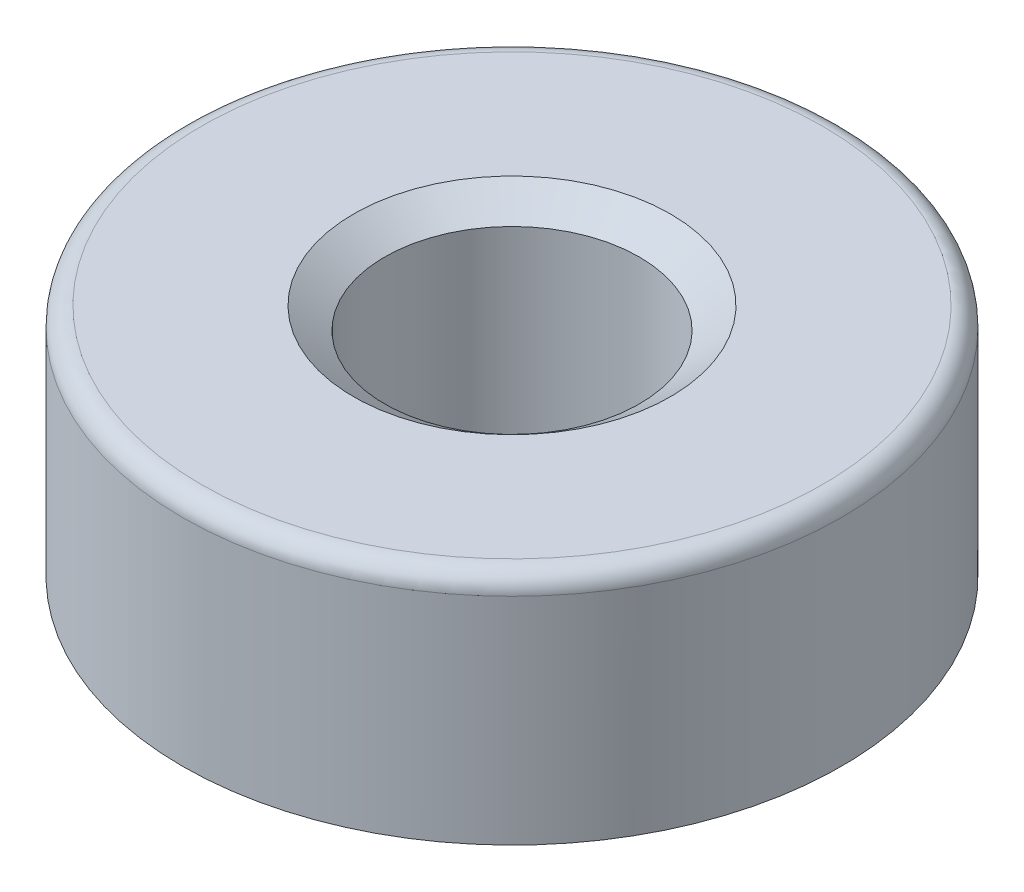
from build123d import *

# Parameters (mm, degrees)
LUGGAP_DEPTH    = 6.35
LUGGAPPAT_COUNT = 3


with BuildPart() as part:
    # BodySke → Body (revolve)
    with BuildSketch(Plane.XY, mode=Mode.PRIVATE) as body_sk:
        with BuildLine():
            Line((4.0005, 0), (4.8674655, 0))
            Line((4.8674655, 0), (5.7370345, -0.6096))
            Line((5.7370345, -0.6096), (6.604, 0))
            Line((6.604, 0), (6.604, 4.318))
            ThreePointArc((6.604, 4.318), (6.492407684, 4.587407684), (6.223, 4.699))
            Line((6.223, 4.699), (2.5527, 4.699))
            Line((2.5527, 4.699), (2.5527, -1.2192))
            Line((2.5527, -1.2192), (4.0005, -1.2192))
            Line((4.0005, -1.2192), (4.0005, 0))
        make_face()
    revolve(body_sk.sketch.rotate(Axis((0, 4.318, 0), (0, 1, 0)), 90), axis=Axis((0, 4.318, 0), (0, 1, 0)))

    # EndChamferSke → EndChamfer (revolve, cut)
    with BuildSketch(Plane.XY, mode=Mode.PRIVATE) as endchamfer_sk:
        Polygon((3.175, -1.4732), (3.175, -0.9652), (2.5527, -0.529622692), (2.5527, -1.4732), align=None)
        Polygon((3.175, 4.699), (2.5527, 4.263422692), (2.5527, 4.699), align=None)
    revolve(endchamfer_sk.sketch.rotate(Axis((0, -2.54, 0), (0, 1, 0)), 90), axis=Axis((0, -2.54, 0), (0, 1, 0)), mode=Mode.SUBTRACT)

    # LugGapSke → LugGap (cut)
    with BuildSketch(Plane(origin=(0, 0, 0), x_dir=(1, 0, 0), z_dir=(0, 1, 0))):
        with BuildLine():
            Line((-0.925840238, -4.778602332), (-1.830362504, -6.345280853))
            ThreePointArc((-1.830362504, -6.345280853), (3.302, -5.719231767), (6.410355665, -1.5875))
            Line((6.410355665, -1.5875), (4.601311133, -1.5875))
            ThreePointArc((4.601311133, -1.5875), (2.43373275, -4.215348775), (-0.925840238, -4.778602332))
        make_face()
    luggap = extrude(amount=-LUGGAP_DEPTH, mode=Mode.SUBTRACT)

    # LugGapPat: LugGap ×3 about axis
    luggappat_axis = Axis((0, 0, 0), (0, 1, 0))
    for i in range(1, LUGGAPPAT_COUNT):
        add(luggap.rotate(luggappat_axis, i * 360 / LUGGAPPAT_COUNT), mode=Mode.SUBTRACT)


solid = part.part
